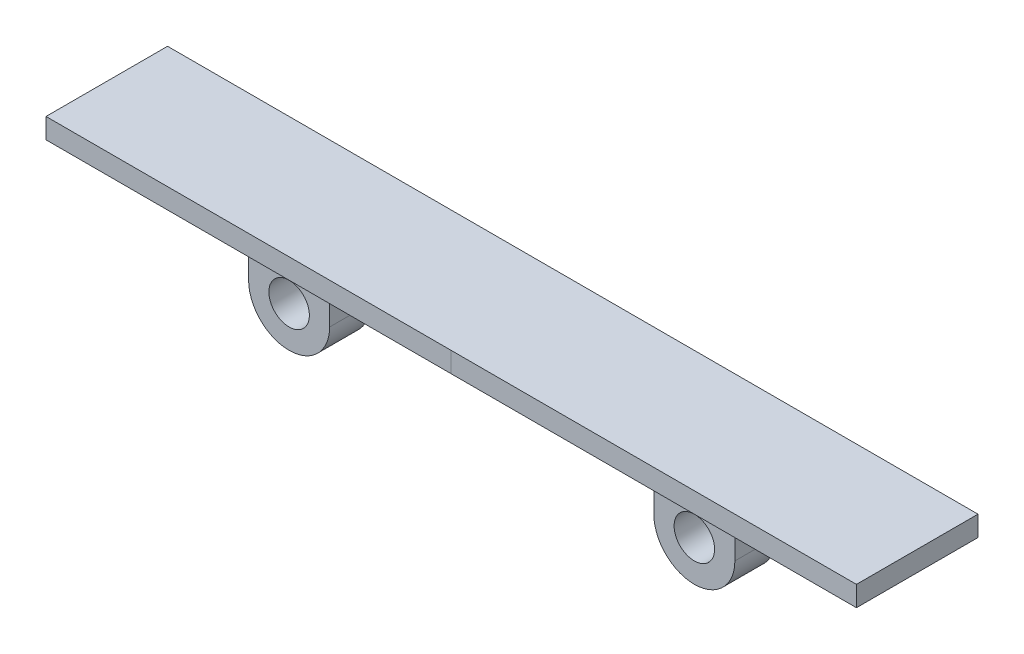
ISO-10303-21;
HEADER;
FILE_DESCRIPTION(('STEP AP214'),'2;1');
FILE_NAME('part.step','',(''),(''),'','','');
FILE_SCHEMA(('AUTOMOTIVE_DESIGN { 1 0 10303 214 1 1 1 1 }'));
ENDSEC;
DATA;
#1=APPLICATION_CONTEXT('core data for automotive mechanical design processes');
#2=APPLICATION_PROTOCOL_DEFINITION('international standard','automotive_design',2000,#1);
#3=PRODUCT_CONTEXT('',#1,'mechanical');
#4=PRODUCT('Part','Part','',(#3));
#5=PRODUCT_RELATED_PRODUCT_CATEGORY('part','',(#4));
#6=PRODUCT_DEFINITION_FORMATION('','',#4);
#7=PRODUCT_DEFINITION_CONTEXT('part definition',#1,'design');
#8=PRODUCT_DEFINITION('design','',#6,#7);
#9=PRODUCT_DEFINITION_SHAPE('','',#8);
#10=(LENGTH_UNIT() NAMED_UNIT(*) SI_UNIT(.MILLI.,.METRE.));
#11=(NAMED_UNIT(*) PLANE_ANGLE_UNIT() SI_UNIT($,.RADIAN.));
#12=(NAMED_UNIT(*) SI_UNIT($,.STERADIAN.) SOLID_ANGLE_UNIT());
#13=UNCERTAINTY_MEASURE_WITH_UNIT(LENGTH_MEASURE(1.E-05),#10,'distance_accuracy_value','');
#14=(GEOMETRIC_REPRESENTATION_CONTEXT(3) GLOBAL_UNCERTAINTY_ASSIGNED_CONTEXT((#13)) GLOBAL_UNIT_ASSIGNED_CONTEXT((#10,
#11,#12)) REPRESENTATION_CONTEXT('',''));
#15=CARTESIAN_POINT('',(0.,0.,0.));
#16=DIRECTION('',(0.,0.,1.));
#17=DIRECTION('',(1.,0.,0.));
#18=AXIS2_PLACEMENT_3D('',#15,#16,#17);
#19=CARTESIAN_POINT('',(-200.,-10.,30.));
#20=DIRECTION('',(0.,0.,1.));
#21=DIRECTION('',(1.,0.,0.));
#22=AXIS2_PLACEMENT_3D('',#19,#20,#21);
#23=PLANE('',#22);
#24=DIRECTION('',(1.,0.,0.));
#25=VECTOR('',#24,1.);
#26=CARTESIAN_POINT('',(-200.,-10.,30.));
#27=LINE('',#26,#25);
#28=CARTESIAN_POINT('',(-200.,-10.,30.));
#29=VERTEX_POINT('',#28);
#30=CARTESIAN_POINT('',(0.,-10.,30.));
#31=VERTEX_POINT('',#30);
#32=EDGE_CURVE('E166',#29,#31,#27,.T.);
#33=ORIENTED_EDGE('',*,*,#32,.T.);
#34=DIRECTION('',(0.,1.,0.));
#35=VECTOR('',#34,1.);
#36=CARTESIAN_POINT('',(0.,-10.,30.));
#37=LINE('',#36,#35);
#38=CARTESIAN_POINT('',(0.,0.,30.));
#39=VERTEX_POINT('',#38);
#40=EDGE_CURVE('E11',#31,#39,#37,.T.);
#41=ORIENTED_EDGE('',*,*,#40,.T.);
#42=DIRECTION('',(1.,0.,0.));
#43=VECTOR('',#42,1.);
#44=CARTESIAN_POINT('',(-200.,0.,30.));
#45=LINE('',#44,#43);
#46=CARTESIAN_POINT('',(-200.,0.,30.));
#47=VERTEX_POINT('',#46);
#48=EDGE_CURVE('E168',#47,#39,#45,.T.);
#49=ORIENTED_EDGE('',*,*,#48,.F.);
#50=DIRECTION('',(0.,1.,0.));
#51=VECTOR('',#50,1.);
#52=CARTESIAN_POINT('',(-200.,-10.,30.));
#53=LINE('',#52,#51);
#54=EDGE_CURVE('E164',#29,#47,#53,.T.);
#55=ORIENTED_EDGE('',*,*,#54,.F.);
#56=EDGE_LOOP('',(#33,#41,#49,#55));
#57=FACE_BOUND('',#56,.T.);
#58=ADVANCED_FACE('F32',(#57),#23,.T.);
#59=CARTESIAN_POINT('',(-200.,-10.,-30.));
#60=DIRECTION('',(0.,0.,-1.));
#61=DIRECTION('',(-1.,0.,0.));
#62=AXIS2_PLACEMENT_3D('',#59,#60,#61);
#63=PLANE('',#62);
#64=DIRECTION('',(-1.,0.,0.));
#65=VECTOR('',#64,1.);
#66=CARTESIAN_POINT('',(-200.,0.,-30.));
#67=LINE('',#66,#65);
#68=CARTESIAN_POINT('',(0.,0.,-30.));
#69=VERTEX_POINT('',#68);
#70=CARTESIAN_POINT('',(-200.,0.,-30.));
#71=VERTEX_POINT('',#70);
#72=EDGE_CURVE('E193',#69,#71,#67,.T.);
#73=ORIENTED_EDGE('',*,*,#72,.F.);
#74=DIRECTION('',(0.,-1.,0.));
#75=VECTOR('',#74,1.);
#76=CARTESIAN_POINT('',(0.,-10.,-30.));
#77=LINE('',#76,#75);
#78=CARTESIAN_POINT('',(0.,-10.,-30.));
#79=VERTEX_POINT('',#78);
#80=EDGE_CURVE('E41',#69,#79,#77,.T.);
#81=ORIENTED_EDGE('',*,*,#80,.T.);
#82=DIRECTION('',(-1.,0.,0.));
#83=VECTOR('',#82,1.);
#84=CARTESIAN_POINT('',(-200.,-10.,-30.));
#85=LINE('',#84,#83);
#86=CARTESIAN_POINT('',(-200.,-10.,-30.));
#87=VERTEX_POINT('',#86);
#88=EDGE_CURVE('E201',#79,#87,#85,.T.);
#89=ORIENTED_EDGE('',*,*,#88,.T.);
#90=DIRECTION('',(0.,1.,0.));
#91=VECTOR('',#90,1.);
#92=CARTESIAN_POINT('',(-200.,-10.,-30.));
#93=LINE('',#92,#91);
#94=EDGE_CURVE('E189',#87,#71,#93,.T.);
#95=ORIENTED_EDGE('',*,*,#94,.T.);
#96=EDGE_LOOP('',(#73,#81,#89,#95));
#97=FACE_BOUND('',#96,.T.);
#98=ADVANCED_FACE('F301',(#97),#63,.T.);
#99=CARTESIAN_POINT('',(120.,-60.,10.));
#100=DIRECTION('',(0.,0.,1.));
#101=DIRECTION('',(1.,0.,0.));
#102=AXIS2_PLACEMENT_3D('',#99,#100,#101);
#103=PLANE('',#102);
#104=DIRECTION('',(0.,1.,0.));
#105=VECTOR('',#104,1.);
#106=CARTESIAN_POINT('',(79.9999999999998,-60.,10.));
#107=LINE('',#106,#105);
#108=CARTESIAN_POINT('',(79.9999999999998,-40.,10.));
#109=VERTEX_POINT('',#108);
#110=CARTESIAN_POINT('',(79.9999999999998,-15.,10.));
#111=VERTEX_POINT('',#110);
#112=EDGE_CURVE('E387',#109,#111,#107,.T.);
#113=ORIENTED_EDGE('',*,*,#112,.F.);
#114=CARTESIAN_POINT('',(99.9999999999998,-40.,10.));
#115=DIRECTION('',(0.,0.,1.));
#116=DIRECTION('',(1.,0.,0.));
#117=AXIS2_PLACEMENT_3D('',#114,#115,#116);
#118=CIRCLE('',#117,20.);
#119=CARTESIAN_POINT('',(99.9999999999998,-60.,10.));
#120=VERTEX_POINT('',#119);
#121=EDGE_CURVE('E264',#109,#120,#118,.T.);
#122=ORIENTED_EDGE('',*,*,#121,.T.);
#123=CARTESIAN_POINT('',(99.9999999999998,-40.,10.));
#124=DIRECTION('',(0.,0.,1.));
#125=DIRECTION('',(1.,0.,0.));
#126=AXIS2_PLACEMENT_3D('',#123,#124,#125);
#127=CIRCLE('',#126,20.);
#128=CARTESIAN_POINT('',(120.,-40.,10.));
#129=VERTEX_POINT('',#128);
#130=EDGE_CURVE('E262',#120,#129,#127,.T.);
#131=ORIENTED_EDGE('',*,*,#130,.T.);
#132=DIRECTION('',(0.,1.,0.));
#133=VECTOR('',#132,1.);
#134=CARTESIAN_POINT('',(120.,-60.,10.));
#135=LINE('',#134,#133);
#136=CARTESIAN_POINT('',(120.,-15.,10.));
#137=VERTEX_POINT('',#136);
#138=EDGE_CURVE('E383',#129,#137,#135,.T.);
#139=ORIENTED_EDGE('',*,*,#138,.T.);
#140=CARTESIAN_POINT('',(125.,-15.,10.));
#141=DIRECTION('',(0.,0.,1.));
#142=DIRECTION('',(1.,0.,0.));
#143=AXIS2_PLACEMENT_3D('',#140,#141,#142);
#144=CIRCLE('',#143,5.);
#145=CARTESIAN_POINT('',(125.,-10.,10.));
#146=VERTEX_POINT('',#145);
#147=EDGE_CURVE('E289',#137,#146,#144,.F.);
#148=ORIENTED_EDGE('',*,*,#147,.T.);
#149=DIRECTION('',(1.,0.,0.));
#150=VECTOR('',#149,1.);
#151=CARTESIAN_POINT('',(120.,-10.,10.));
#152=LINE('',#151,#150);
#153=CARTESIAN_POINT('',(74.9999999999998,-10.,10.));
#154=VERTEX_POINT('',#153);
#155=EDGE_CURVE('E276',#154,#146,#152,.T.);
#156=ORIENTED_EDGE('',*,*,#155,.F.);
#157=CARTESIAN_POINT('',(74.9999999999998,-15.,10.));
#158=DIRECTION('',(0.,0.,1.));
#159=DIRECTION('',(1.,0.,0.));
#160=AXIS2_PLACEMENT_3D('',#157,#158,#159);
#161=CIRCLE('',#160,5.);
#162=EDGE_CURVE('E292',#154,#111,#161,.F.);
#163=ORIENTED_EDGE('',*,*,#162,.T.);
#164=EDGE_LOOP('',(#113,#122,#131,#139,#148,#156,#163));
#165=FACE_BOUND('',#164,.T.);
#166=CARTESIAN_POINT('',(100.,-40.,10.));
#167=DIRECTION('',(0.,0.,1.));
#168=DIRECTION('',(1.,0.,0.));
#169=AXIS2_PLACEMENT_3D('',#166,#167,#168);
#170=CIRCLE('',#169,10.);
#171=CARTESIAN_POINT('',(110.,-40.,10.));
#172=VERTEX_POINT('',#171);
#173=EDGE_CURVE('E277',#172,#172,#170,.F.);
#174=ORIENTED_EDGE('',*,*,#173,.T.);
#175=EDGE_LOOP('',(#174));
#176=FACE_BOUND('',#175,.T.);
#177=ADVANCED_FACE('F330',(#165,#176),#103,.T.);
#178=CARTESIAN_POINT('',(120.,-60.,-9.99999999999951));
#179=DIRECTION('',(0.,0.,-1.));
#180=DIRECTION('',(-1.,0.,0.));
#181=AXIS2_PLACEMENT_3D('',#178,#179,#180);
#182=PLANE('',#181);
#183=CARTESIAN_POINT('',(100.,-40.,-9.99999999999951));
#184=DIRECTION('',(0.,0.,-1.));
#185=DIRECTION('',(-1.,0.,0.));
#186=AXIS2_PLACEMENT_3D('',#183,#184,#185);
#187=CIRCLE('',#186,20.);
#188=CARTESIAN_POINT('',(120.,-40.,-9.99999999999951));
#189=VERTEX_POINT('',#188);
#190=CARTESIAN_POINT('',(100.,-60.,-9.99999999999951));
#191=VERTEX_POINT('',#190);
#192=EDGE_CURVE('E266',#189,#191,#187,.T.);
#193=ORIENTED_EDGE('',*,*,#192,.T.);
#194=CARTESIAN_POINT('',(99.9999999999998,-40.,-9.99999999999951));
#195=DIRECTION('',(0.,0.,-1.));
#196=DIRECTION('',(-1.,0.,0.));
#197=AXIS2_PLACEMENT_3D('',#194,#195,#196);
#198=CIRCLE('',#197,20.);
#199=CARTESIAN_POINT('',(79.9999999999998,-40.,-9.99999999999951));
#200=VERTEX_POINT('',#199);
#201=EDGE_CURVE('E268',#191,#200,#198,.T.);
#202=ORIENTED_EDGE('',*,*,#201,.T.);
#203=DIRECTION('',(0.,1.,0.));
#204=VECTOR('',#203,1.);
#205=CARTESIAN_POINT('',(79.9999999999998,-60.,-9.99999999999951));
#206=LINE('',#205,#204);
#207=CARTESIAN_POINT('',(79.9999999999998,-15.,-9.99999999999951));
#208=VERTEX_POINT('',#207);
#209=EDGE_CURVE('E392',#200,#208,#206,.T.);
#210=ORIENTED_EDGE('',*,*,#209,.T.);
#211=CARTESIAN_POINT('',(74.9999999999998,-15.,-9.99999999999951));
#212=DIRECTION('',(0.,0.,-1.));
#213=DIRECTION('',(-1.,0.,0.));
#214=AXIS2_PLACEMENT_3D('',#211,#212,#213);
#215=CIRCLE('',#214,5.);
#216=CARTESIAN_POINT('',(74.9999999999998,-10.,-9.99999999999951));
#217=VERTEX_POINT('',#216);
#218=EDGE_CURVE('E294',#208,#217,#215,.F.);
#219=ORIENTED_EDGE('',*,*,#218,.T.);
#220=DIRECTION('',(-1.,0.,0.));
#221=VECTOR('',#220,1.);
#222=CARTESIAN_POINT('',(120.,-10.,-9.99999999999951));
#223=LINE('',#222,#221);
#224=CARTESIAN_POINT('',(125.,-10.,-9.99999999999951));
#225=VERTEX_POINT('',#224);
#226=EDGE_CURVE('E446',#225,#217,#223,.T.);
#227=ORIENTED_EDGE('',*,*,#226,.F.);
#228=CARTESIAN_POINT('',(125.,-15.,-9.99999999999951));
#229=DIRECTION('',(0.,0.,-1.));
#230=DIRECTION('',(-1.,0.,0.));
#231=AXIS2_PLACEMENT_3D('',#228,#229,#230);
#232=CIRCLE('',#231,5.);
#233=CARTESIAN_POINT('',(120.,-15.,-9.99999999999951));
#234=VERTEX_POINT('',#233);
#235=EDGE_CURVE('E287',#225,#234,#232,.F.);
#236=ORIENTED_EDGE('',*,*,#235,.T.);
#237=DIRECTION('',(0.,1.,0.));
#238=VECTOR('',#237,1.);
#239=CARTESIAN_POINT('',(120.,-60.,-9.99999999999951));
#240=LINE('',#239,#238);
#241=EDGE_CURVE('E449',#189,#234,#240,.T.);
#242=ORIENTED_EDGE('',*,*,#241,.F.);
#243=EDGE_LOOP('',(#193,#202,#210,#219,#227,#236,#242));
#244=FACE_BOUND('',#243,.T.);
#245=CARTESIAN_POINT('',(100.,-40.,-9.99999999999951));
#246=DIRECTION('',(0.,0.,1.));
#247=DIRECTION('',(1.,0.,0.));
#248=AXIS2_PLACEMENT_3D('',#245,#246,#247);
#249=CIRCLE('',#248,10.);
#250=CARTESIAN_POINT('',(110.,-40.,-9.99999999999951));
#251=VERTEX_POINT('',#250);
#252=EDGE_CURVE('E639',#251,#251,#249,.T.);
#253=ORIENTED_EDGE('',*,*,#252,.T.);
#254=EDGE_LOOP('',(#253));
#255=FACE_BOUND('',#254,.T.);
#256=ADVANCED_FACE('F439',(#244,#255),#182,.T.);
#257=CARTESIAN_POINT('',(-200.,-10.,-30.));
#258=DIRECTION('',(0.,1.,0.));
#259=DIRECTION('',(0.,0.,1.));
#260=AXIS2_PLACEMENT_3D('',#257,#258,#259);
#261=PLANE('',#260);
#262=DIRECTION('',(0.,0.,-1.));
#263=VECTOR('',#262,1.);
#264=CARTESIAN_POINT('',(125.,-10.,-29.9999999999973));
#265=LINE('',#264,#263);
#266=EDGE_CURVE('E280',#146,#225,#265,.T.);
#267=ORIENTED_EDGE('',*,*,#266,.T.);
#268=ORIENTED_EDGE('',*,*,#226,.T.);
#269=DIRECTION('',(0.,0.,1.));
#270=VECTOR('',#269,1.);
#271=CARTESIAN_POINT('',(74.9999999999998,-10.,-30.));
#272=LINE('',#271,#270);
#273=EDGE_CURVE('E272',#217,#154,#272,.T.);
#274=ORIENTED_EDGE('',*,*,#273,.T.);
#275=ORIENTED_EDGE('',*,*,#155,.T.);
#276=EDGE_LOOP('',(#267,#268,#274,#275));
#277=FACE_BOUND('',#276,.T.);
#278=DIRECTION('',(0.,0.,1.));
#279=VECTOR('',#278,1.);
#280=CARTESIAN_POINT('',(-200.,-10.,-30.));
#281=LINE('',#280,#279);
#282=EDGE_CURVE('E181',#87,#29,#281,.T.);
#283=ORIENTED_EDGE('',*,*,#282,.F.);
#284=ORIENTED_EDGE('',*,*,#88,.F.);
#285=CARTESIAN_POINT('',(200.,-10.,-30.));
#286=VERTEX_POINT('',#285);
#287=EDGE_CURVE('E174',#286,#79,#85,.T.);
#288=ORIENTED_EDGE('',*,*,#287,.F.);
#289=DIRECTION('',(0.,0.,-1.));
#290=VECTOR('',#289,1.);
#291=CARTESIAN_POINT('',(200.,-10.,-30.));
#292=LINE('',#291,#290);
#293=CARTESIAN_POINT('',(200.,-10.,30.));
#294=VERTEX_POINT('',#293);
#295=EDGE_CURVE('E184',#294,#286,#292,.T.);
#296=ORIENTED_EDGE('',*,*,#295,.F.);
#297=EDGE_CURVE('E183',#31,#294,#27,.T.);
#298=ORIENTED_EDGE('',*,*,#297,.F.);
#299=ORIENTED_EDGE('',*,*,#32,.F.);
#300=EDGE_LOOP('',(#283,#284,#288,#296,#298,#299));
#301=FACE_BOUND('',#300,.T.);
#302=DIRECTION('',(1.,0.,0.));
#303=VECTOR('',#302,1.);
#304=CARTESIAN_POINT('',(-120.,-10.,-9.99999999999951));
#305=LINE('',#304,#303);
#306=CARTESIAN_POINT('',(-125.,-10.,-9.99999999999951));
#307=VERTEX_POINT('',#306);
#308=CARTESIAN_POINT('',(-74.9999999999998,-10.,-9.99999999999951));
#309=VERTEX_POINT('',#308);
#310=EDGE_CURVE('E233',#307,#309,#305,.T.);
#311=ORIENTED_EDGE('',*,*,#310,.F.);
#312=DIRECTION('',(0.,0.,-1.));
#313=VECTOR('',#312,1.);
#314=CARTESIAN_POINT('',(-125.,-10.,10.));
#315=LINE('',#314,#313);
#316=CARTESIAN_POINT('',(-125.,-10.,10.));
#317=VERTEX_POINT('',#316);
#318=EDGE_CURVE('E243',#307,#317,#315,.F.);
#319=ORIENTED_EDGE('',*,*,#318,.T.);
#320=DIRECTION('',(-1.,0.,0.));
#321=VECTOR('',#320,1.);
#322=CARTESIAN_POINT('',(-120.,-10.,10.));
#323=LINE('',#322,#321);
#324=CARTESIAN_POINT('',(-74.9999999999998,-10.,10.));
#325=VERTEX_POINT('',#324);
#326=EDGE_CURVE('E397',#325,#317,#323,.T.);
#327=ORIENTED_EDGE('',*,*,#326,.F.);
#328=DIRECTION('',(0.,0.,1.));
#329=VECTOR('',#328,1.);
#330=CARTESIAN_POINT('',(-74.9999999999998,-10.,-9.99999999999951));
#331=LINE('',#330,#329);
#332=EDGE_CURVE('E240',#325,#309,#331,.F.);
#333=ORIENTED_EDGE('',*,*,#332,.T.);
#334=EDGE_LOOP('',(#311,#319,#327,#333));
#335=FACE_BOUND('',#334,.T.);
#336=ADVANCED_FACE('F178',(#277,#301,#335),#261,.F.);
#337=CARTESIAN_POINT('',(-200.,-10.,-30.));
#338=DIRECTION('',(-1.,0.,0.));
#339=DIRECTION('',(0.,0.,1.));
#340=AXIS2_PLACEMENT_3D('',#337,#338,#339);
#341=PLANE('',#340);
#342=DIRECTION('',(0.,0.,1.));
#343=VECTOR('',#342,1.);
#344=CARTESIAN_POINT('',(-200.,0.,-30.));
#345=LINE('',#344,#343);
#346=EDGE_CURVE('E204',#71,#47,#345,.T.);
#347=ORIENTED_EDGE('',*,*,#346,.F.);
#348=ORIENTED_EDGE('',*,*,#94,.F.);
#349=ORIENTED_EDGE('',*,*,#282,.T.);
#350=ORIENTED_EDGE('',*,*,#54,.T.);
#351=EDGE_LOOP('',(#347,#348,#349,#350));
#352=FACE_BOUND('',#351,.T.);
#353=ADVANCED_FACE('F187',(#352),#341,.T.);
#354=ORIENTED_EDGE('',*,*,#80,.F.);
#355=CARTESIAN_POINT('',(200.,0.,-30.));
#356=VERTEX_POINT('',#355);
#357=EDGE_CURVE('E190',#356,#69,#67,.T.);
#358=ORIENTED_EDGE('',*,*,#357,.F.);
#359=DIRECTION('',(0.,1.,0.));
#360=VECTOR('',#359,1.);
#361=CARTESIAN_POINT('',(200.,-10.,-30.));
#362=LINE('',#361,#360);
#363=EDGE_CURVE('E213',#286,#356,#362,.T.);
#364=ORIENTED_EDGE('',*,*,#363,.F.);
#365=ORIENTED_EDGE('',*,*,#287,.T.);
#366=EDGE_LOOP('',(#354,#358,#364,#365));
#367=FACE_BOUND('',#366,.T.);
#368=ADVANCED_FACE('F305',(#367),#63,.T.);
#369=CARTESIAN_POINT('',(200.,-10.,-30.));
#370=DIRECTION('',(1.,0.,0.));
#371=DIRECTION('',(0.,0.,-1.));
#372=AXIS2_PLACEMENT_3D('',#369,#370,#371);
#373=PLANE('',#372);
#374=DIRECTION('',(0.,0.,-1.));
#375=VECTOR('',#374,1.);
#376=CARTESIAN_POINT('',(200.,0.,-30.));
#377=LINE('',#376,#375);
#378=CARTESIAN_POINT('',(200.,0.,30.));
#379=VERTEX_POINT('',#378);
#380=EDGE_CURVE('E208',#379,#356,#377,.T.);
#381=ORIENTED_EDGE('',*,*,#380,.F.);
#382=DIRECTION('',(0.,1.,0.));
#383=VECTOR('',#382,1.);
#384=CARTESIAN_POINT('',(200.,-10.,30.));
#385=LINE('',#384,#383);
#386=EDGE_CURVE('E173',#294,#379,#385,.T.);
#387=ORIENTED_EDGE('',*,*,#386,.F.);
#388=ORIENTED_EDGE('',*,*,#295,.T.);
#389=ORIENTED_EDGE('',*,*,#363,.T.);
#390=EDGE_LOOP('',(#381,#387,#388,#389));
#391=FACE_BOUND('',#390,.T.);
#392=ADVANCED_FACE('F309',(#391),#373,.T.);
#393=ORIENTED_EDGE('',*,*,#40,.F.);
#394=ORIENTED_EDGE('',*,*,#297,.T.);
#395=ORIENTED_EDGE('',*,*,#386,.T.);
#396=EDGE_CURVE('E206',#39,#379,#45,.T.);
#397=ORIENTED_EDGE('',*,*,#396,.F.);
#398=EDGE_LOOP('',(#393,#394,#395,#397));
#399=FACE_BOUND('',#398,.T.);
#400=ADVANCED_FACE('F310',(#399),#23,.T.);
#401=CARTESIAN_POINT('',(-200.,0.,-30.));
#402=DIRECTION('',(0.,1.,0.));
#403=DIRECTION('',(0.,0.,1.));
#404=AXIS2_PLACEMENT_3D('',#401,#402,#403);
#405=PLANE('',#404);
#406=ORIENTED_EDGE('',*,*,#346,.T.);
#407=ORIENTED_EDGE('',*,*,#48,.T.);
#408=ORIENTED_EDGE('',*,*,#396,.T.);
#409=ORIENTED_EDGE('',*,*,#380,.T.);
#410=ORIENTED_EDGE('',*,*,#357,.T.);
#411=ORIENTED_EDGE('',*,*,#72,.T.);
#412=EDGE_LOOP('',(#406,#407,#408,#409,#410,#411));
#413=FACE_BOUND('',#412,.T.);
#414=ADVANCED_FACE('F312',(#413),#405,.T.);
#415=CARTESIAN_POINT('',(-120.,-60.,-9.99999999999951));
#416=DIRECTION('',(1.,0.,0.));
#417=DIRECTION('',(0.,0.,-1.));
#418=AXIS2_PLACEMENT_3D('',#415,#416,#417);
#419=PLANE('',#418);
#420=DIRECTION('',(0.,1.,0.));
#421=VECTOR('',#420,1.);
#422=CARTESIAN_POINT('',(-120.,-60.,10.));
#423=LINE('',#422,#421);
#424=CARTESIAN_POINT('',(-120.,-40.,10.));
#425=VERTEX_POINT('',#424);
#426=CARTESIAN_POINT('',(-120.,-15.,10.));
#427=VERTEX_POINT('',#426);
#428=EDGE_CURVE('E399',#425,#427,#423,.T.);
#429=ORIENTED_EDGE('',*,*,#428,.T.);
#430=DIRECTION('',(0.,0.,-1.));
#431=VECTOR('',#430,1.);
#432=CARTESIAN_POINT('',(-120.,-15.,-9.99999999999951));
#433=LINE('',#432,#431);
#434=CARTESIAN_POINT('',(-120.,-15.,-9.99999999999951));
#435=VERTEX_POINT('',#434);
#436=EDGE_CURVE('E229',#427,#435,#433,.T.);
#437=ORIENTED_EDGE('',*,*,#436,.T.);
#438=DIRECTION('',(0.,1.,0.));
#439=VECTOR('',#438,1.);
#440=CARTESIAN_POINT('',(-120.,-60.,-9.99999999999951));
#441=LINE('',#440,#439);
#442=CARTESIAN_POINT('',(-120.,-40.,-9.99999999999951));
#443=VERTEX_POINT('',#442);
#444=EDGE_CURVE('E196',#443,#435,#441,.T.);
#445=ORIENTED_EDGE('',*,*,#444,.F.);
#446=DIRECTION('',(0.,0.,-1.));
#447=VECTOR('',#446,1.);
#448=CARTESIAN_POINT('',(-120.,-40.,-9.99999999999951));
#449=LINE('',#448,#447);
#450=EDGE_CURVE('E227',#443,#425,#449,.F.);
#451=ORIENTED_EDGE('',*,*,#450,.T.);
#452=EDGE_LOOP('',(#429,#437,#445,#451));
#453=FACE_BOUND('',#452,.T.);
#454=ADVANCED_FACE('F314',(#453),#419,.F.);
#455=CARTESIAN_POINT('',(-120.,-60.,-9.99999999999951));
#456=DIRECTION('',(0.,0.,1.));
#457=DIRECTION('',(1.,0.,0.));
#458=AXIS2_PLACEMENT_3D('',#455,#456,#457);
#459=PLANE('',#458);
#460=CARTESIAN_POINT('',(-100.,-40.,-9.99999999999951));
#461=DIRECTION('',(0.,0.,-1.));
#462=DIRECTION('',(-1.,0.,0.));
#463=AXIS2_PLACEMENT_3D('',#460,#461,#462);
#464=CIRCLE('',#463,10.);
#465=CARTESIAN_POINT('',(-110.,-40.,-9.99999999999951));
#466=VERTEX_POINT('',#465);
#467=EDGE_CURVE('E237',#466,#466,#464,.T.);
#468=ORIENTED_EDGE('',*,*,#467,.F.);
#469=EDGE_LOOP('',(#468));
#470=FACE_BOUND('',#469,.T.);
#471=DIRECTION('',(0.,1.,0.));
#472=VECTOR('',#471,1.);
#473=CARTESIAN_POINT('',(-79.9999999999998,-60.,-9.99999999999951));
#474=LINE('',#473,#472);
#475=CARTESIAN_POINT('',(-79.9999999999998,-40.,-9.99999999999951));
#476=VERTEX_POINT('',#475);
#477=CARTESIAN_POINT('',(-79.9999999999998,-15.,-9.99999999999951));
#478=VERTEX_POINT('',#477);
#479=EDGE_CURVE('E404',#476,#478,#474,.T.);
#480=ORIENTED_EDGE('',*,*,#479,.F.);
#481=CARTESIAN_POINT('',(-99.9999999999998,-40.,-9.99999999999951));
#482=DIRECTION('',(0.,0.,1.));
#483=DIRECTION('',(1.,0.,0.));
#484=AXIS2_PLACEMENT_3D('',#481,#482,#483);
#485=CIRCLE('',#484,20.);
#486=CARTESIAN_POINT('',(-100.,-60.,-9.99999999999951));
#487=VERTEX_POINT('',#486);
#488=EDGE_CURVE('E225',#476,#487,#485,.F.);
#489=ORIENTED_EDGE('',*,*,#488,.T.);
#490=CARTESIAN_POINT('',(-100.,-40.,-9.99999999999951));
#491=DIRECTION('',(0.,0.,1.));
#492=DIRECTION('',(1.,0.,0.));
#493=AXIS2_PLACEMENT_3D('',#490,#491,#492);
#494=CIRCLE('',#493,20.);
#495=EDGE_CURVE('E223',#487,#443,#494,.F.);
#496=ORIENTED_EDGE('',*,*,#495,.T.);
#497=ORIENTED_EDGE('',*,*,#444,.T.);
#498=CARTESIAN_POINT('',(-125.,-15.,-9.99999999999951));
#499=DIRECTION('',(0.,0.,1.));
#500=DIRECTION('',(1.,0.,0.));
#501=AXIS2_PLACEMENT_3D('',#498,#499,#500);
#502=CIRCLE('',#501,5.);
#503=EDGE_CURVE('E249',#435,#307,#502,.T.);
#504=ORIENTED_EDGE('',*,*,#503,.T.);
#505=ORIENTED_EDGE('',*,*,#310,.T.);
#506=CARTESIAN_POINT('',(-74.9999999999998,-15.,-9.99999999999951));
#507=DIRECTION('',(0.,0.,1.));
#508=DIRECTION('',(1.,0.,0.));
#509=AXIS2_PLACEMENT_3D('',#506,#507,#508);
#510=CIRCLE('',#509,5.);
#511=EDGE_CURVE('E257',#309,#478,#510,.T.);
#512=ORIENTED_EDGE('',*,*,#511,.T.);
#513=EDGE_LOOP('',(#480,#489,#496,#497,#504,#505,#512));
#514=FACE_BOUND('',#513,.T.);
#515=ADVANCED_FACE('F320',(#470,#514),#459,.F.);
#516=CARTESIAN_POINT('',(-79.9999999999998,-60.,-9.99999999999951));
#517=DIRECTION('',(-1.,0.,0.));
#518=DIRECTION('',(0.,0.,1.));
#519=AXIS2_PLACEMENT_3D('',#516,#517,#518);
#520=PLANE('',#519);
#521=ORIENTED_EDGE('',*,*,#479,.T.);
#522=DIRECTION('',(0.,0.,1.));
#523=VECTOR('',#522,1.);
#524=CARTESIAN_POINT('',(-79.9999999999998,-15.,10.));
#525=LINE('',#524,#523);
#526=CARTESIAN_POINT('',(-79.9999999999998,-15.,10.));
#527=VERTEX_POINT('',#526);
#528=EDGE_CURVE('E246',#478,#527,#525,.T.);
#529=ORIENTED_EDGE('',*,*,#528,.T.);
#530=DIRECTION('',(0.,1.,0.));
#531=VECTOR('',#530,1.);
#532=CARTESIAN_POINT('',(-79.9999999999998,-60.,10.));
#533=LINE('',#532,#531);
#534=CARTESIAN_POINT('',(-79.9999999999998,-40.,10.));
#535=VERTEX_POINT('',#534);
#536=EDGE_CURVE('E402',#535,#527,#533,.T.);
#537=ORIENTED_EDGE('',*,*,#536,.F.);
#538=DIRECTION('',(0.,0.,1.));
#539=VECTOR('',#538,1.);
#540=CARTESIAN_POINT('',(-79.9999999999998,-40.,-9.99999999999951));
#541=LINE('',#540,#539);
#542=EDGE_CURVE('E220',#535,#476,#541,.F.);
#543=ORIENTED_EDGE('',*,*,#542,.T.);
#544=EDGE_LOOP('',(#521,#529,#537,#543));
#545=FACE_BOUND('',#544,.T.);
#546=ADVANCED_FACE('F425',(#545),#520,.F.);
#547=CARTESIAN_POINT('',(-120.,-60.,10.));
#548=DIRECTION('',(0.,0.,-1.));
#549=DIRECTION('',(-1.,0.,0.));
#550=AXIS2_PLACEMENT_3D('',#547,#548,#549);
#551=PLANE('',#550);
#552=CARTESIAN_POINT('',(-100.,-40.,10.));
#553=DIRECTION('',(0.,0.,-1.));
#554=DIRECTION('',(-1.,0.,0.));
#555=AXIS2_PLACEMENT_3D('',#552,#553,#554);
#556=CIRCLE('',#555,10.);
#557=CARTESIAN_POINT('',(-110.,-40.,10.));
#558=VERTEX_POINT('',#557);
#559=EDGE_CURVE('E234',#558,#558,#556,.T.);
#560=ORIENTED_EDGE('',*,*,#559,.T.);
#561=EDGE_LOOP('',(#560));
#562=FACE_BOUND('',#561,.T.);
#563=CARTESIAN_POINT('',(-99.9999999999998,-40.,10.));
#564=DIRECTION('',(0.,0.,-1.));
#565=DIRECTION('',(-1.,0.,0.));
#566=AXIS2_PLACEMENT_3D('',#563,#564,#565);
#567=CIRCLE('',#566,20.);
#568=CARTESIAN_POINT('',(-99.9999999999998,-60.,10.));
#569=VERTEX_POINT('',#568);
#570=EDGE_CURVE('E212',#425,#569,#567,.F.);
#571=ORIENTED_EDGE('',*,*,#570,.T.);
#572=CARTESIAN_POINT('',(-99.9999999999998,-40.,10.));
#573=DIRECTION('',(0.,0.,-1.));
#574=DIRECTION('',(-1.,0.,0.));
#575=AXIS2_PLACEMENT_3D('',#572,#573,#574);
#576=CIRCLE('',#575,20.);
#577=EDGE_CURVE('E218',#569,#535,#576,.F.);
#578=ORIENTED_EDGE('',*,*,#577,.T.);
#579=ORIENTED_EDGE('',*,*,#536,.T.);
#580=CARTESIAN_POINT('',(-74.9999999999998,-15.,10.));
#581=DIRECTION('',(0.,0.,-1.));
#582=DIRECTION('',(-1.,0.,0.));
#583=AXIS2_PLACEMENT_3D('',#580,#581,#582);
#584=CIRCLE('',#583,5.);
#585=EDGE_CURVE('E254',#527,#325,#584,.T.);
#586=ORIENTED_EDGE('',*,*,#585,.T.);
#587=ORIENTED_EDGE('',*,*,#326,.T.);
#588=CARTESIAN_POINT('',(-125.,-15.,10.));
#589=DIRECTION('',(0.,0.,-1.));
#590=DIRECTION('',(-1.,0.,0.));
#591=AXIS2_PLACEMENT_3D('',#588,#589,#590);
#592=CIRCLE('',#591,5.);
#593=EDGE_CURVE('E252',#317,#427,#592,.T.);
#594=ORIENTED_EDGE('',*,*,#593,.T.);
#595=ORIENTED_EDGE('',*,*,#428,.F.);
#596=EDGE_LOOP('',(#571,#578,#579,#586,#587,#594,#595));
#597=FACE_BOUND('',#596,.T.);
#598=ADVANCED_FACE('F343',(#562,#597),#551,.F.);
#599=CARTESIAN_POINT('',(-99.9999999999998,-40.,9.99999999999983));
#600=DIRECTION('',(0.,0.,-1.));
#601=DIRECTION('',(-1.,0.,0.));
#602=AXIS2_PLACEMENT_3D('',#599,#600,#601);
#603=CYLINDRICAL_SURFACE('',#602,20.);
#604=ORIENTED_EDGE('',*,*,#450,.F.);
#605=ORIENTED_EDGE('',*,*,#495,.F.);
#606=DIRECTION('',(0.,0.,-1.));
#607=VECTOR('',#606,1.);
#608=CARTESIAN_POINT('',(-99.9999999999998,-60.,9.99999999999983));
#609=LINE('',#608,#607);
#610=EDGE_CURVE('E230',#569,#487,#609,.T.);
#611=ORIENTED_EDGE('',*,*,#610,.F.);
#612=ORIENTED_EDGE('',*,*,#570,.F.);
#613=EDGE_LOOP('',(#604,#605,#611,#612));
#614=FACE_BOUND('',#613,.T.);
#615=ADVANCED_FACE('F339',(#614),#603,.T.);
#616=CARTESIAN_POINT('',(-99.9999999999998,-40.,10.));
#617=DIRECTION('',(0.,0.,1.));
#618=DIRECTION('',(1.,0.,0.));
#619=AXIS2_PLACEMENT_3D('',#616,#617,#618);
#620=CYLINDRICAL_SURFACE('',#619,20.);
#621=ORIENTED_EDGE('',*,*,#488,.F.);
#622=ORIENTED_EDGE('',*,*,#542,.F.);
#623=ORIENTED_EDGE('',*,*,#577,.F.);
#624=ORIENTED_EDGE('',*,*,#610,.T.);
#625=EDGE_LOOP('',(#621,#622,#623,#624));
#626=FACE_BOUND('',#625,.T.);
#627=ADVANCED_FACE('F335',(#626),#620,.T.);
#628=CARTESIAN_POINT('',(-100.,-40.,30.));
#629=DIRECTION('',(0.,0.,-1.));
#630=DIRECTION('',(-1.,0.,0.));
#631=AXIS2_PLACEMENT_3D('',#628,#629,#630);
#632=CYLINDRICAL_SURFACE('',#631,10.);
#633=ORIENTED_EDGE('',*,*,#467,.T.);
#634=EDGE_LOOP('',(#633));
#635=FACE_BOUND('',#634,.T.);
#636=ORIENTED_EDGE('',*,*,#559,.F.);
#637=EDGE_LOOP('',(#636));
#638=FACE_BOUND('',#637,.T.);
#639=ADVANCED_FACE('F338',(#635,#638),#632,.F.);
#640=CARTESIAN_POINT('',(-125.,-15.,-9.99999999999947));
#641=DIRECTION('',(0.,0.,1.));
#642=DIRECTION('',(1.,0.,0.));
#643=AXIS2_PLACEMENT_3D('',#640,#641,#642);
#644=CYLINDRICAL_SURFACE('',#643,5.);
#645=ORIENTED_EDGE('',*,*,#593,.F.);
#646=ORIENTED_EDGE('',*,*,#318,.F.);
#647=ORIENTED_EDGE('',*,*,#503,.F.);
#648=ORIENTED_EDGE('',*,*,#436,.F.);
#649=EDGE_LOOP('',(#645,#646,#647,#648));
#650=FACE_BOUND('',#649,.T.);
#651=ADVANCED_FACE('F345',(#650),#644,.F.);
#652=CARTESIAN_POINT('',(-74.9999999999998,-15.,-9.99999999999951));
#653=DIRECTION('',(0.,0.,-1.));
#654=DIRECTION('',(-1.,0.,0.));
#655=AXIS2_PLACEMENT_3D('',#652,#653,#654);
#656=CYLINDRICAL_SURFACE('',#655,5.);
#657=ORIENTED_EDGE('',*,*,#511,.F.);
#658=ORIENTED_EDGE('',*,*,#332,.F.);
#659=ORIENTED_EDGE('',*,*,#585,.F.);
#660=ORIENTED_EDGE('',*,*,#528,.F.);
#661=EDGE_LOOP('',(#657,#658,#659,#660));
#662=FACE_BOUND('',#661,.T.);
#663=ADVANCED_FACE('F348',(#662),#656,.F.);
#664=CARTESIAN_POINT('',(120.,-60.,-9.99999999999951));
#665=DIRECTION('',(1.,0.,0.));
#666=DIRECTION('',(0.,0.,-1.));
#667=AXIS2_PLACEMENT_3D('',#664,#665,#666);
#668=PLANE('',#667);
#669=ORIENTED_EDGE('',*,*,#241,.T.);
#670=DIRECTION('',(0.,0.,-1.));
#671=VECTOR('',#670,1.);
#672=CARTESIAN_POINT('',(120.,-15.,-9.99999999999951));
#673=LINE('',#672,#671);
#674=EDGE_CURVE('E283',#234,#137,#673,.F.);
#675=ORIENTED_EDGE('',*,*,#674,.T.);
#676=ORIENTED_EDGE('',*,*,#138,.F.);
#677=DIRECTION('',(0.,0.,-1.));
#678=VECTOR('',#677,1.);
#679=CARTESIAN_POINT('',(120.,-40.,-9.99999999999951));
#680=LINE('',#679,#678);
#681=EDGE_CURVE('E270',#129,#189,#680,.T.);
#682=ORIENTED_EDGE('',*,*,#681,.T.);
#683=EDGE_LOOP('',(#669,#675,#676,#682));
#684=FACE_BOUND('',#683,.T.);
#685=ADVANCED_FACE('F352',(#684),#668,.T.);
#686=CARTESIAN_POINT('',(79.9999999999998,-60.,-9.99999999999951));
#687=DIRECTION('',(-1.,0.,0.));
#688=DIRECTION('',(0.,0.,1.));
#689=AXIS2_PLACEMENT_3D('',#686,#687,#688);
#690=PLANE('',#689);
#691=ORIENTED_EDGE('',*,*,#112,.T.);
#692=DIRECTION('',(0.,0.,1.));
#693=VECTOR('',#692,1.);
#694=CARTESIAN_POINT('',(79.9999999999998,-15.,-9.99999999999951));
#695=LINE('',#694,#693);
#696=EDGE_CURVE('E285',#111,#208,#695,.F.);
#697=ORIENTED_EDGE('',*,*,#696,.T.);
#698=ORIENTED_EDGE('',*,*,#209,.F.);
#699=DIRECTION('',(0.,0.,1.));
#700=VECTOR('',#699,1.);
#701=CARTESIAN_POINT('',(79.9999999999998,-40.,10.));
#702=LINE('',#701,#700);
#703=EDGE_CURVE('E259',#200,#109,#702,.T.);
#704=ORIENTED_EDGE('',*,*,#703,.T.);
#705=EDGE_LOOP('',(#691,#697,#698,#704));
#706=FACE_BOUND('',#705,.T.);
#707=ADVANCED_FACE('F361',(#706),#690,.T.);
#708=CARTESIAN_POINT('',(100.,-40.,-9.99999999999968));
#709=DIRECTION('',(0.,0.,1.));
#710=DIRECTION('',(1.,0.,0.));
#711=AXIS2_PLACEMENT_3D('',#708,#709,#710);
#712=CYLINDRICAL_SURFACE('',#711,20.);
#713=DIRECTION('',(0.,0.,-1.));
#714=VECTOR('',#713,1.);
#715=CARTESIAN_POINT('',(99.9999999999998,-60.,9.99999999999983));
#716=LINE('',#715,#714);
#717=EDGE_CURVE('E273',#191,#120,#716,.F.);
#718=ORIENTED_EDGE('',*,*,#717,.F.);
#719=ORIENTED_EDGE('',*,*,#192,.F.);
#720=ORIENTED_EDGE('',*,*,#681,.F.);
#721=ORIENTED_EDGE('',*,*,#130,.F.);
#722=EDGE_LOOP('',(#718,#719,#720,#721));
#723=FACE_BOUND('',#722,.T.);
#724=ADVANCED_FACE('F358',(#723),#712,.T.);
#725=CARTESIAN_POINT('',(99.9999999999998,-40.,-9.99999999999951));
#726=DIRECTION('',(0.,0.,-1.));
#727=DIRECTION('',(-1.,0.,0.));
#728=AXIS2_PLACEMENT_3D('',#725,#726,#727);
#729=CYLINDRICAL_SURFACE('',#728,20.);
#730=ORIENTED_EDGE('',*,*,#201,.F.);
#731=ORIENTED_EDGE('',*,*,#717,.T.);
#732=ORIENTED_EDGE('',*,*,#121,.F.);
#733=ORIENTED_EDGE('',*,*,#703,.F.);
#734=EDGE_LOOP('',(#730,#731,#732,#733));
#735=FACE_BOUND('',#734,.T.);
#736=ADVANCED_FACE('F354',(#735),#729,.T.);
#737=CARTESIAN_POINT('',(100.,-40.,30.));
#738=DIRECTION('',(0.,0.,-1.));
#739=DIRECTION('',(-1.,0.,0.));
#740=AXIS2_PLACEMENT_3D('',#737,#738,#739);
#741=CYLINDRICAL_SURFACE('',#740,10.);
#742=ORIENTED_EDGE('',*,*,#173,.F.);
#743=EDGE_LOOP('',(#742));
#744=FACE_BOUND('',#743,.T.);
#745=ORIENTED_EDGE('',*,*,#252,.F.);
#746=EDGE_LOOP('',(#745));
#747=FACE_BOUND('',#746,.T.);
#748=ADVANCED_FACE('F357',(#744,#747),#741,.F.);
#749=CARTESIAN_POINT('',(125.,-15.,-29.9999999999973));
#750=DIRECTION('',(0.,0.,-1.));
#751=DIRECTION('',(-1.,0.,0.));
#752=AXIS2_PLACEMENT_3D('',#749,#750,#751);
#753=CYLINDRICAL_SURFACE('',#752,5.);
#754=ORIENTED_EDGE('',*,*,#147,.F.);
#755=ORIENTED_EDGE('',*,*,#674,.F.);
#756=ORIENTED_EDGE('',*,*,#235,.F.);
#757=ORIENTED_EDGE('',*,*,#266,.F.);
#758=EDGE_LOOP('',(#754,#755,#756,#757));
#759=FACE_BOUND('',#758,.T.);
#760=ADVANCED_FACE('F363',(#759),#753,.F.);
#761=CARTESIAN_POINT('',(74.9999999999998,-15.,-30.));
#762=DIRECTION('',(0.,0.,1.));
#763=DIRECTION('',(1.,0.,0.));
#764=AXIS2_PLACEMENT_3D('',#761,#762,#763);
#765=CYLINDRICAL_SURFACE('',#764,5.);
#766=ORIENTED_EDGE('',*,*,#218,.F.);
#767=ORIENTED_EDGE('',*,*,#696,.F.);
#768=ORIENTED_EDGE('',*,*,#162,.F.);
#769=ORIENTED_EDGE('',*,*,#273,.F.);
#770=EDGE_LOOP('',(#766,#767,#768,#769));
#771=FACE_BOUND('',#770,.T.);
#772=ADVANCED_FACE('F34',(#771),#765,.F.);
#773=CLOSED_SHELL('',(#58,#98,#177,#256,#336,#353,#368,#392,#400,#414,#454,#515,#546,#598,#615,
#627,#639,#651,#663,#685,#707,#724,#736,#748,#760,#772));
#774=MANIFOLD_SOLID_BREP('B2',#773);
#775=ADVANCED_BREP_SHAPE_REPRESENTATION('',(#18,#774),#14);
#776=SHAPE_DEFINITION_REPRESENTATION(#9,#775);
ENDSEC;
END-ISO-10303-21;
